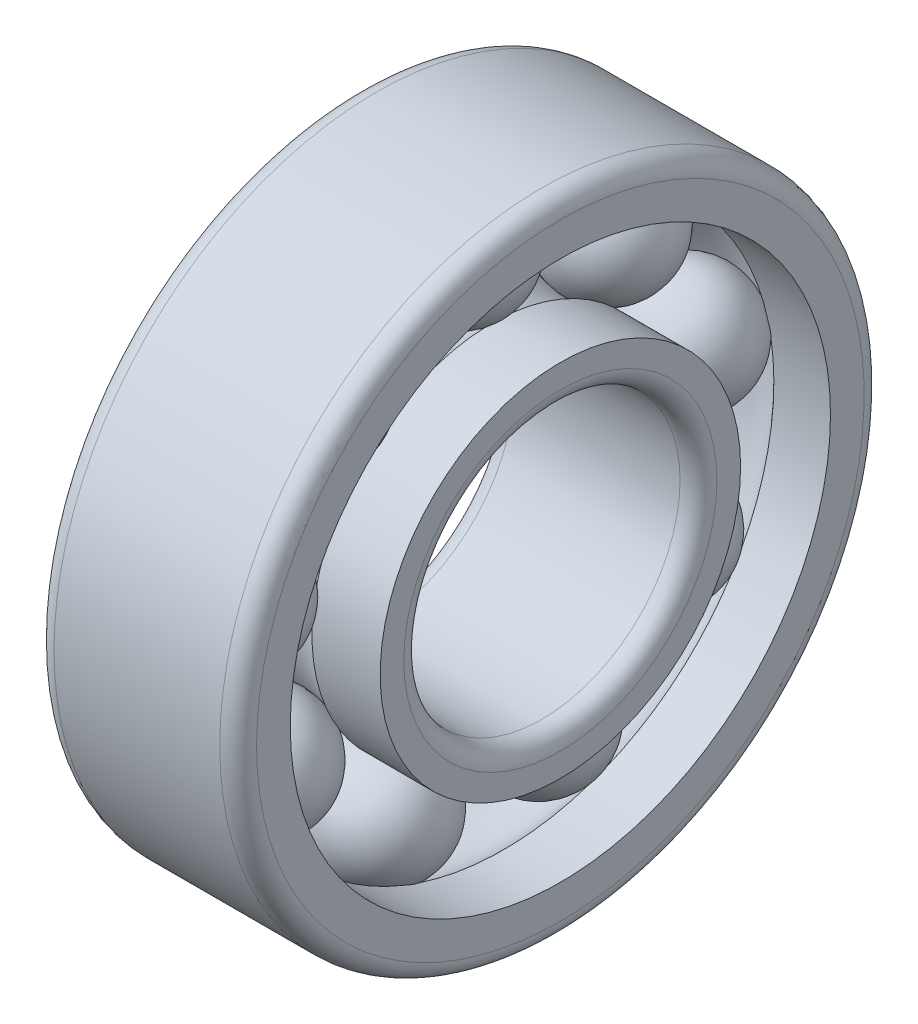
from build123d import *

# Parameters (mm, degrees)
NBR_DE_BILLES_COUNT = 9


with BuildPart() as part:
    # Esquisse1 → Bague int (revolve)
    with BuildSketch(Plane.XY, mode=Mode.PRIVATE) as bague_int_sk:
        with BuildLine():
            Line((5.5, 9.787968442), (1.79895822, 9.787968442))
            ThreePointArc((1.79895822, 9.787968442), (0, 9.24556213), (-1.79895822, 9.787968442))
            Line((-1.79895822, 9.787968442), (-5.5, 9.787968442))
            Line((-5.5, 9.787968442), (-5.5, 8.5))
            ThreePointArc((-5.5, 8.5), (-5.207106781, 7.792893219), (-4.5, 7.5))
            Line((-4.5, 7.5), (4.5, 7.5))
            ThreePointArc((4.5, 7.5), (5.207106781, 7.792893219), (5.5, 8.5))
            Line((5.5, 8.5), (5.5, 9.787968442))
        make_face()
    revolve(bague_int_sk.sketch.rotate(Axis((5, 0, 0), (-1, 0, 0)), 90), axis=Axis((5, 0, 0), (-1, 0, 0)))

    # Esquisse3 → Bille (revolve)
    with BuildSketch(Plane.XY):
        with BuildLine():
            Line((-3.27943787, 12.5), (3.27943787, 12.5))
            ThreePointArc((3.27943787, 12.5), (0, 9.22056213), (-3.27943787, 12.5))
        make_face()
    bille = revolve(axis=Axis((-6.749183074, 12.5, 0), (1, 0, 0)))

    # Esquisse2 → Bague ext (revolve)
    with BuildSketch(Plane.XY, mode=Mode.PRIVATE) as bague_ext_sk:
        with BuildLine():
            Line((-4.5, 17.5), (4.5, 17.5))
            ThreePointArc((4.5, 17.5), (5.207106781, 17.207106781), (5.5, 16.5))
            Line((5.5, 16.5), (5.5, 14.669625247))
            Line((5.5, 14.669625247), (2.425714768, 14.669625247))
            ThreePointArc((2.425714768, 14.669625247), (0, 15.75443787), (-2.425714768, 14.669625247))
            Line((-2.425714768, 14.669625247), (-5.5, 14.669625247))
            Line((-5.5, 14.669625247), (-5.5, 16.5))
            ThreePointArc((-5.5, 16.5), (-5.207106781, 17.207106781), (-4.5, 17.5))
        make_face()
    revolve(bague_ext_sk.sketch.rotate(Axis((-5, 0, 0), (1, 0, 0)), 90), axis=Axis((-5, 0, 0), (1, 0, 0)))

    # Nbr de billes: Bille ×9 about axis
    nbr_de_billes_axis = Axis((0, 0, 0), (1, 0, 0))
    for i in range(1, NBR_DE_BILLES_COUNT):
        add(bille.rotate(nbr_de_billes_axis, i * 360 / NBR_DE_BILLES_COUNT))


solid = part.part
